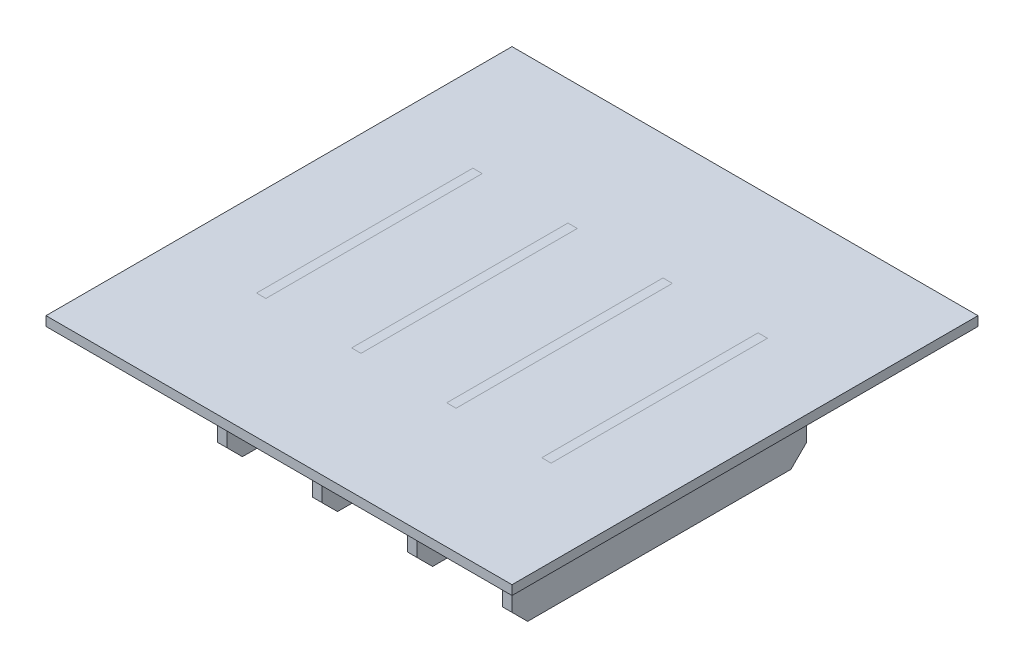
from build123d import *

# Parameters (mm, degrees)
SKETCH1_W           = 595
SKETCH1_H           = 595
BOSS_EXTRUDE1_DEPTH = 12
SKETCH3_W           = 12
SKETCH3_H           = 376.2
BOSS_EXTRUDE2_DEPTH = 148
CHAMFER1_SIZE       = 20
SKETCH4_W           = 12
SKETCH4_H           = 276.2
BOSS_EXTRUDE3_DEPTH = 12
SKETCH5_W           = 12
SKETCH5_H           = 276.2
CUT_EXTRUDE1_DEPTH  = 451.124982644
LPATTERN1_COUNT     = 4
LPATTERN1_PITCH     = 121.4
LPATTERN2_COUNT     = 4
LPATTERN2_PITCH     = 121.4


with BuildPart() as part:
    # Sketch1 → Boss-Extrude1 (new body)
    with BuildSketch(Plane(origin=(0, 0, 0), x_dir=(1, 0, 0), z_dir=(0, 1, 0))):
        Rectangle(SKETCH1_W, SKETCH1_H)
    extrude(amount=BOSS_EXTRUDE1_DEPTH)

    # Sketch5 → Cut-Extrude1 (cut, through all)
    with BuildSketch(Plane(origin=(0, 12, 0), x_dir=(1, 0, 0), z_dir=(0, 1, 0))):
        with Locations((-182.1, 0)):
            Rectangle(SKETCH5_W, SKETCH5_H)
    cut_extrude1 = extrude(amount=-CUT_EXTRUDE1_DEPTH, mode=Mode.SUBTRACT)

    # LPattern2: Cut-Extrude1 ×4
    with Locations(*[(i * LPATTERN2_PITCH, 0, 0) for i in range(1, LPATTERN2_COUNT)]):
        add(cut_extrude1, mode=Mode.SUBTRACT)


with BuildPart() as body_2:
    # Sketch3 → Boss-Extrude2 (new body)
    with BuildSketch(Plane.XZ):
        with Locations((-182.1, 0)):
            Rectangle(SKETCH3_W, SKETCH3_H)
    extrude(amount=BOSS_EXTRUDE2_DEPTH)

    # Chamfer1
    chamfer1_edges = [body_2.edges().sort_by_distance(p)[0] for p in [
        (-182.1, -148, 188.1),
        (-182.1, -148, -188.1),
    ]]
    chamfer(chamfer1_edges, length=CHAMFER1_SIZE)

    # Sketch4 → Boss-Extrude3 (add)
    with BuildSketch(Plane(origin=(0, 0, 0), x_dir=(1, 0, 0), z_dir=(0, 1, 0))):
        with Locations((-182.1, 0)):
            Rectangle(SKETCH4_W, SKETCH4_H)
    extrude(amount=BOSS_EXTRUDE3_DEPTH)


with BuildPart() as lpattern1_1:
    # LPattern1: pattern copy
    add(body_2.part.moved(Location(Vector(1, 0, 0) * (1 * LPATTERN1_PITCH))))


with BuildPart() as lpattern1_2:
    # LPattern1: pattern copy
    add(body_2.part.moved(Location(Vector(1, 0, 0) * (2 * LPATTERN1_PITCH))))


with BuildPart() as lpattern1_3:
    # LPattern1: pattern copy
    add(body_2.part.moved(Location(Vector(1, 0, 0) * (3 * LPATTERN1_PITCH))))


solid = Compound([part.part, body_2.part, lpattern1_1.part, lpattern1_2.part, lpattern1_3.part])
